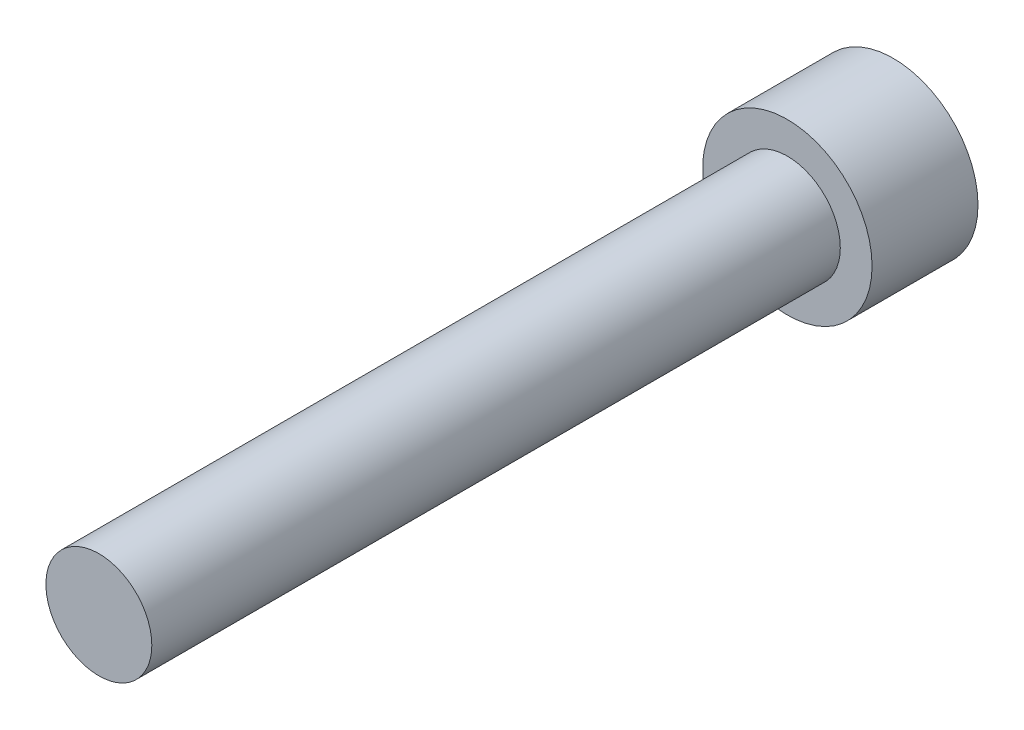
ISO-10303-21;
HEADER;
FILE_DESCRIPTION(('STEP AP214'),'2;1');
FILE_NAME('part.step','',(''),(''),'','','');
FILE_SCHEMA(('AUTOMOTIVE_DESIGN { 1 0 10303 214 1 1 1 1 }'));
ENDSEC;
DATA;
#1=APPLICATION_CONTEXT('core data for automotive mechanical design processes');
#2=APPLICATION_PROTOCOL_DEFINITION('international standard','automotive_design',2000,#1);
#3=PRODUCT_CONTEXT('',#1,'mechanical');
#4=PRODUCT('Part','Part','',(#3));
#5=PRODUCT_RELATED_PRODUCT_CATEGORY('part','',(#4));
#6=PRODUCT_DEFINITION_FORMATION('','',#4);
#7=PRODUCT_DEFINITION_CONTEXT('part definition',#1,'design');
#8=PRODUCT_DEFINITION('design','',#6,#7);
#9=PRODUCT_DEFINITION_SHAPE('','',#8);
#10=(LENGTH_UNIT() NAMED_UNIT(*) SI_UNIT(.MILLI.,.METRE.));
#11=(NAMED_UNIT(*) PLANE_ANGLE_UNIT() SI_UNIT($,.RADIAN.));
#12=(NAMED_UNIT(*) SI_UNIT($,.STERADIAN.) SOLID_ANGLE_UNIT());
#13=UNCERTAINTY_MEASURE_WITH_UNIT(LENGTH_MEASURE(1.E-05),#10,'distance_accuracy_value','');
#14=(GEOMETRIC_REPRESENTATION_CONTEXT(3) GLOBAL_UNCERTAINTY_ASSIGNED_CONTEXT((#13)) GLOBAL_UNIT_ASSIGNED_CONTEXT((#10,
#11,#12)) REPRESENTATION_CONTEXT('',''));
#15=CARTESIAN_POINT('',(0.,0.,0.));
#16=DIRECTION('',(0.,0.,1.));
#17=DIRECTION('',(1.,0.,0.));
#18=AXIS2_PLACEMENT_3D('',#15,#16,#17);
#19=CARTESIAN_POINT('',(0.,0.,65.));
#20=DIRECTION('',(0.,0.,1.));
#21=DIRECTION('',(1.,0.,0.));
#22=AXIS2_PLACEMENT_3D('',#19,#20,#21);
#23=PLANE('',#22);
#24=CARTESIAN_POINT('',(0.,0.,65.));
#25=DIRECTION('',(0.,0.,1.));
#26=DIRECTION('',(1.,0.,0.));
#27=AXIS2_PLACEMENT_3D('',#24,#25,#26);
#28=CIRCLE('',#27,5.);
#29=CARTESIAN_POINT('',(5.,0.,65.));
#30=VERTEX_POINT('',#29);
#31=EDGE_CURVE('E11',#30,#30,#28,.T.);
#32=ORIENTED_EDGE('',*,*,#31,.T.);
#33=EDGE_LOOP('',(#32));
#34=FACE_BOUND('',#33,.T.);
#35=ADVANCED_FACE('F32',(#34),#23,.T.);
#36=CARTESIAN_POINT('',(0.,0.,65.));
#37=DIRECTION('',(0.,0.,1.));
#38=DIRECTION('',(1.,0.,0.));
#39=AXIS2_PLACEMENT_3D('',#36,#37,#38);
#40=CYLINDRICAL_SURFACE('',#39,5.);
#41=CARTESIAN_POINT('',(0.,0.,0.));
#42=DIRECTION('',(0.,0.,1.));
#43=DIRECTION('',(1.,0.,0.));
#44=AXIS2_PLACEMENT_3D('',#41,#42,#43);
#45=CIRCLE('',#44,5.);
#46=CARTESIAN_POINT('',(5.,0.,0.));
#47=VERTEX_POINT('',#46);
#48=EDGE_CURVE('E39',#47,#47,#45,.T.);
#49=ORIENTED_EDGE('',*,*,#48,.T.);
#50=EDGE_LOOP('',(#49));
#51=FACE_BOUND('',#50,.T.);
#52=ORIENTED_EDGE('',*,*,#31,.F.);
#53=EDGE_LOOP('',(#52));
#54=FACE_BOUND('',#53,.T.);
#55=ADVANCED_FACE('F146',(#51,#54),#40,.T.);
#56=CARTESIAN_POINT('',(0.,-5.,0.));
#57=DIRECTION('',(0.,0.,1.));
#58=DIRECTION('',(1.,0.,0.));
#59=AXIS2_PLACEMENT_3D('',#56,#57,#58);
#60=PLANE('',#59);
#61=CARTESIAN_POINT('',(0.,0.,0.));
#62=DIRECTION('',(0.,0.,1.));
#63=DIRECTION('',(1.,0.,0.));
#64=AXIS2_PLACEMENT_3D('',#61,#62,#63);
#65=CIRCLE('',#64,8.);
#66=CARTESIAN_POINT('',(8.,0.,0.));
#67=VERTEX_POINT('',#66);
#68=EDGE_CURVE('E141',#67,#67,#65,.T.);
#69=ORIENTED_EDGE('',*,*,#68,.T.);
#70=EDGE_LOOP('',(#69));
#71=FACE_BOUND('',#70,.T.);
#72=ORIENTED_EDGE('',*,*,#48,.F.);
#73=EDGE_LOOP('',(#72));
#74=FACE_BOUND('',#73,.T.);
#75=ADVANCED_FACE('F149',(#71,#74),#60,.T.);
#76=CARTESIAN_POINT('',(0.,0.,65.));
#77=DIRECTION('',(0.,0.,1.));
#78=DIRECTION('',(1.,0.,0.));
#79=AXIS2_PLACEMENT_3D('',#76,#77,#78);
#80=CYLINDRICAL_SURFACE('',#79,8.);
#81=CARTESIAN_POINT('',(0.,0.,-9.99999999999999));
#82=DIRECTION('',(0.,0.,1.));
#83=DIRECTION('',(1.,0.,0.));
#84=AXIS2_PLACEMENT_3D('',#81,#82,#83);
#85=CIRCLE('',#84,8.);
#86=CARTESIAN_POINT('',(8.,0.,-9.99999999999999));
#87=VERTEX_POINT('',#86);
#88=EDGE_CURVE('E133',#87,#87,#85,.T.);
#89=ORIENTED_EDGE('',*,*,#88,.T.);
#90=EDGE_LOOP('',(#89));
#91=FACE_BOUND('',#90,.T.);
#92=ORIENTED_EDGE('',*,*,#68,.F.);
#93=EDGE_LOOP('',(#92));
#94=FACE_BOUND('',#93,.T.);
#95=ADVANCED_FACE('F151',(#91,#94),#80,.T.);
#96=CARTESIAN_POINT('',(0.,-8.,-10.));
#97=DIRECTION('',(0.,0.,-1.));
#98=DIRECTION('',(-1.,0.,0.));
#99=AXIS2_PLACEMENT_3D('',#96,#97,#98);
#100=PLANE('',#99);
#101=DIRECTION('',(0.866025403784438,-0.5,0.));
#102=VECTOR('',#101,1.);
#103=CARTESIAN_POINT('',(0.,4.61880215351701,-10.));
#104=LINE('',#103,#102);
#105=CARTESIAN_POINT('',(0.,4.61880215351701,-10.));
#106=VERTEX_POINT('',#105);
#107=CARTESIAN_POINT('',(4.,2.3094010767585,-10.));
#108=VERTEX_POINT('',#107);
#109=EDGE_CURVE('E46',#106,#108,#104,.T.);
#110=ORIENTED_EDGE('',*,*,#109,.F.);
#111=DIRECTION('',(0.866025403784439,0.5,0.));
#112=VECTOR('',#111,1.);
#113=CARTESIAN_POINT('',(-4.,2.3094010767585,-10.));
#114=LINE('',#113,#112);
#115=CARTESIAN_POINT('',(-4.,2.3094010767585,-10.));
#116=VERTEX_POINT('',#115);
#117=EDGE_CURVE('E129',#116,#106,#114,.T.);
#118=ORIENTED_EDGE('',*,*,#117,.F.);
#119=DIRECTION('',(0.,1.,0.));
#120=VECTOR('',#119,1.);
#121=CARTESIAN_POINT('',(-4.,-2.3094010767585,-10.));
#122=LINE('',#121,#120);
#123=CARTESIAN_POINT('',(-4.,-2.3094010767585,-10.));
#124=VERTEX_POINT('',#123);
#125=EDGE_CURVE('E127',#124,#116,#122,.T.);
#126=ORIENTED_EDGE('',*,*,#125,.F.);
#127=DIRECTION('',(-0.866025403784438,0.5,0.));
#128=VECTOR('',#127,1.);
#129=CARTESIAN_POINT('',(0.,-4.61880215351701,-10.));
#130=LINE('',#129,#128);
#131=CARTESIAN_POINT('',(0.,-4.61880215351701,-10.));
#132=VERTEX_POINT('',#131);
#133=EDGE_CURVE('E94',#132,#124,#130,.T.);
#134=ORIENTED_EDGE('',*,*,#133,.F.);
#135=DIRECTION('',(-0.866025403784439,-0.5,0.));
#136=VECTOR('',#135,1.);
#137=CARTESIAN_POINT('',(4.,-2.3094010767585,-10.));
#138=LINE('',#137,#136);
#139=CARTESIAN_POINT('',(4.,-2.3094010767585,-10.));
#140=VERTEX_POINT('',#139);
#141=EDGE_CURVE('E123',#140,#132,#138,.T.);
#142=ORIENTED_EDGE('',*,*,#141,.F.);
#143=DIRECTION('',(0.,-1.,0.));
#144=VECTOR('',#143,1.);
#145=CARTESIAN_POINT('',(4.,2.3094010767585,-10.));
#146=LINE('',#145,#144);
#147=EDGE_CURVE('E120',#108,#140,#146,.T.);
#148=ORIENTED_EDGE('',*,*,#147,.F.);
#149=EDGE_LOOP('',(#110,#118,#126,#134,#142,#148));
#150=FACE_BOUND('',#149,.T.);
#151=ORIENTED_EDGE('',*,*,#88,.F.);
#152=EDGE_LOOP('',(#151));
#153=FACE_BOUND('',#152,.T.);
#154=ADVANCED_FACE('F158',(#150,#153),#100,.T.);
#155=CARTESIAN_POINT('',(0.,4.61880215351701,-2.));
#156=DIRECTION('',(0.5,0.866025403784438,0.));
#157=DIRECTION('',(-0.866025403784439,0.5,0.));
#158=AXIS2_PLACEMENT_3D('',#155,#156,#157);
#159=PLANE('',#158);
#160=ORIENTED_EDGE('',*,*,#109,.T.);
#161=DIRECTION('',(0.,0.,-1.));
#162=VECTOR('',#161,1.);
#163=CARTESIAN_POINT('',(4.,2.3094010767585,-2.));
#164=LINE('',#163,#162);
#165=CARTESIAN_POINT('',(4.,2.3094010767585,-2.));
#166=VERTEX_POINT('',#165);
#167=EDGE_CURVE('E76',#166,#108,#164,.T.);
#168=ORIENTED_EDGE('',*,*,#167,.F.);
#169=DIRECTION('',(0.866025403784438,-0.5,0.));
#170=VECTOR('',#169,1.);
#171=CARTESIAN_POINT('',(0.,4.61880215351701,-2.));
#172=LINE('',#171,#170);
#173=CARTESIAN_POINT('',(0.,4.61880215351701,-2.));
#174=VERTEX_POINT('',#173);
#175=EDGE_CURVE('E131',#174,#166,#172,.T.);
#176=ORIENTED_EDGE('',*,*,#175,.F.);
#177=DIRECTION('',(0.,0.,-1.));
#178=VECTOR('',#177,1.);
#179=CARTESIAN_POINT('',(0.,4.61880215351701,-2.));
#180=LINE('',#179,#178);
#181=EDGE_CURVE('E54',#174,#106,#180,.T.);
#182=ORIENTED_EDGE('',*,*,#181,.T.);
#183=EDGE_LOOP('',(#160,#168,#176,#182));
#184=FACE_BOUND('',#183,.T.);
#185=ADVANCED_FACE('F189',(#184),#159,.F.);
#186=CARTESIAN_POINT('',(-4.,2.3094010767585,-2.));
#187=DIRECTION('',(-0.5,0.866025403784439,0.));
#188=DIRECTION('',(-0.866025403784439,-0.5,0.));
#189=AXIS2_PLACEMENT_3D('',#186,#187,#188);
#190=PLANE('',#189);
#191=ORIENTED_EDGE('',*,*,#117,.T.);
#192=ORIENTED_EDGE('',*,*,#181,.F.);
#193=DIRECTION('',(0.866025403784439,0.5,0.));
#194=VECTOR('',#193,1.);
#195=CARTESIAN_POINT('',(-4.,2.3094010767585,-2.));
#196=LINE('',#195,#194);
#197=CARTESIAN_POINT('',(-4.,2.3094010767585,-2.));
#198=VERTEX_POINT('',#197);
#199=EDGE_CURVE('E106',#198,#174,#196,.T.);
#200=ORIENTED_EDGE('',*,*,#199,.F.);
#201=DIRECTION('',(0.,0.,-1.));
#202=VECTOR('',#201,1.);
#203=CARTESIAN_POINT('',(-4.,2.3094010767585,-2.));
#204=LINE('',#203,#202);
#205=EDGE_CURVE('E98',#198,#116,#204,.T.);
#206=ORIENTED_EDGE('',*,*,#205,.T.);
#207=EDGE_LOOP('',(#191,#192,#200,#206));
#208=FACE_BOUND('',#207,.T.);
#209=ADVANCED_FACE('F199',(#208),#190,.F.);
#210=CARTESIAN_POINT('',(-4.,-2.3094010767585,-2.));
#211=DIRECTION('',(-1.,0.,0.));
#212=DIRECTION('',(0.,0.,1.));
#213=AXIS2_PLACEMENT_3D('',#210,#211,#212);
#214=PLANE('',#213);
#215=ORIENTED_EDGE('',*,*,#125,.T.);
#216=ORIENTED_EDGE('',*,*,#205,.F.);
#217=DIRECTION('',(0.,1.,0.));
#218=VECTOR('',#217,1.);
#219=CARTESIAN_POINT('',(-4.,-2.3094010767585,-2.));
#220=LINE('',#219,#218);
#221=CARTESIAN_POINT('',(-4.,-2.3094010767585,-2.));
#222=VERTEX_POINT('',#221);
#223=EDGE_CURVE('E102',#222,#198,#220,.T.);
#224=ORIENTED_EDGE('',*,*,#223,.F.);
#225=DIRECTION('',(0.,0.,-1.));
#226=VECTOR('',#225,1.);
#227=CARTESIAN_POINT('',(-4.,-2.3094010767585,-2.));
#228=LINE('',#227,#226);
#229=EDGE_CURVE('E87',#222,#124,#228,.T.);
#230=ORIENTED_EDGE('',*,*,#229,.T.);
#231=EDGE_LOOP('',(#215,#216,#224,#230));
#232=FACE_BOUND('',#231,.T.);
#233=ADVANCED_FACE('F103',(#232),#214,.F.);
#234=CARTESIAN_POINT('',(0.,-4.61880215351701,-2.));
#235=DIRECTION('',(-0.5,-0.866025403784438,0.));
#236=DIRECTION('',(0.866025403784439,-0.5,0.));
#237=AXIS2_PLACEMENT_3D('',#234,#235,#236);
#238=PLANE('',#237);
#239=ORIENTED_EDGE('',*,*,#133,.T.);
#240=ORIENTED_EDGE('',*,*,#229,.F.);
#241=DIRECTION('',(-0.866025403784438,0.5,0.));
#242=VECTOR('',#241,1.);
#243=CARTESIAN_POINT('',(0.,-4.61880215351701,-2.));
#244=LINE('',#243,#242);
#245=CARTESIAN_POINT('',(0.,-4.61880215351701,-2.));
#246=VERTEX_POINT('',#245);
#247=EDGE_CURVE('E91',#246,#222,#244,.T.);
#248=ORIENTED_EDGE('',*,*,#247,.F.);
#249=DIRECTION('',(0.,0.,-1.));
#250=VECTOR('',#249,1.);
#251=CARTESIAN_POINT('',(0.,-4.61880215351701,-2.));
#252=LINE('',#251,#250);
#253=EDGE_CURVE('E99',#246,#132,#252,.T.);
#254=ORIENTED_EDGE('',*,*,#253,.T.);
#255=EDGE_LOOP('',(#239,#240,#248,#254));
#256=FACE_BOUND('',#255,.T.);
#257=ADVANCED_FACE('F89',(#256),#238,.F.);
#258=CARTESIAN_POINT('',(4.,-2.3094010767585,-2.));
#259=DIRECTION('',(0.5,-0.866025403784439,0.));
#260=DIRECTION('',(0.866025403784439,0.5,0.));
#261=AXIS2_PLACEMENT_3D('',#258,#259,#260);
#262=PLANE('',#261);
#263=ORIENTED_EDGE('',*,*,#141,.T.);
#264=ORIENTED_EDGE('',*,*,#253,.F.);
#265=DIRECTION('',(-0.866025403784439,-0.5,0.));
#266=VECTOR('',#265,1.);
#267=CARTESIAN_POINT('',(4.,-2.3094010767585,-2.));
#268=LINE('',#267,#266);
#269=CARTESIAN_POINT('',(4.,-2.3094010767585,-2.));
#270=VERTEX_POINT('',#269);
#271=EDGE_CURVE('E112',#270,#246,#268,.T.);
#272=ORIENTED_EDGE('',*,*,#271,.F.);
#273=DIRECTION('',(0.,0.,-1.));
#274=VECTOR('',#273,1.);
#275=CARTESIAN_POINT('',(4.,-2.3094010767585,-2.));
#276=LINE('',#275,#274);
#277=EDGE_CURVE('E136',#270,#140,#276,.T.);
#278=ORIENTED_EDGE('',*,*,#277,.T.);
#279=EDGE_LOOP('',(#263,#264,#272,#278));
#280=FACE_BOUND('',#279,.T.);
#281=ADVANCED_FACE('F224',(#280),#262,.F.);
#282=CARTESIAN_POINT('',(4.,2.3094010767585,-2.));
#283=DIRECTION('',(1.,0.,0.));
#284=DIRECTION('',(0.,0.,-1.));
#285=AXIS2_PLACEMENT_3D('',#282,#283,#284);
#286=PLANE('',#285);
#287=ORIENTED_EDGE('',*,*,#147,.T.);
#288=ORIENTED_EDGE('',*,*,#277,.F.);
#289=DIRECTION('',(0.,-1.,0.));
#290=VECTOR('',#289,1.);
#291=CARTESIAN_POINT('',(4.,2.3094010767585,-2.));
#292=LINE('',#291,#290);
#293=EDGE_CURVE('E114',#166,#270,#292,.T.);
#294=ORIENTED_EDGE('',*,*,#293,.F.);
#295=ORIENTED_EDGE('',*,*,#167,.T.);
#296=EDGE_LOOP('',(#287,#288,#294,#295));
#297=FACE_BOUND('',#296,.T.);
#298=ADVANCED_FACE('F233',(#297),#286,.F.);
#299=CARTESIAN_POINT('',(8.,0.,-2.));
#300=DIRECTION('',(0.,0.,-1.));
#301=DIRECTION('',(-1.,0.,0.));
#302=AXIS2_PLACEMENT_3D('',#299,#300,#301);
#303=PLANE('',#302);
#304=ORIENTED_EDGE('',*,*,#175,.T.);
#305=ORIENTED_EDGE('',*,*,#293,.T.);
#306=ORIENTED_EDGE('',*,*,#271,.T.);
#307=ORIENTED_EDGE('',*,*,#247,.T.);
#308=ORIENTED_EDGE('',*,*,#223,.T.);
#309=ORIENTED_EDGE('',*,*,#199,.T.);
#310=EDGE_LOOP('',(#304,#305,#306,#307,#308,#309));
#311=FACE_BOUND('',#310,.T.);
#312=ADVANCED_FACE('F109',(#311),#303,.T.);
#313=CLOSED_SHELL('',(#35,#55,#75,#95,#154,#185,#209,#233,#257,#281,#298,#312));
#314=MANIFOLD_SOLID_BREP('B2',#313);
#315=ADVANCED_BREP_SHAPE_REPRESENTATION('',(#18,#314),#14);
#316=SHAPE_DEFINITION_REPRESENTATION(#9,#315);
ENDSEC;
END-ISO-10303-21;
